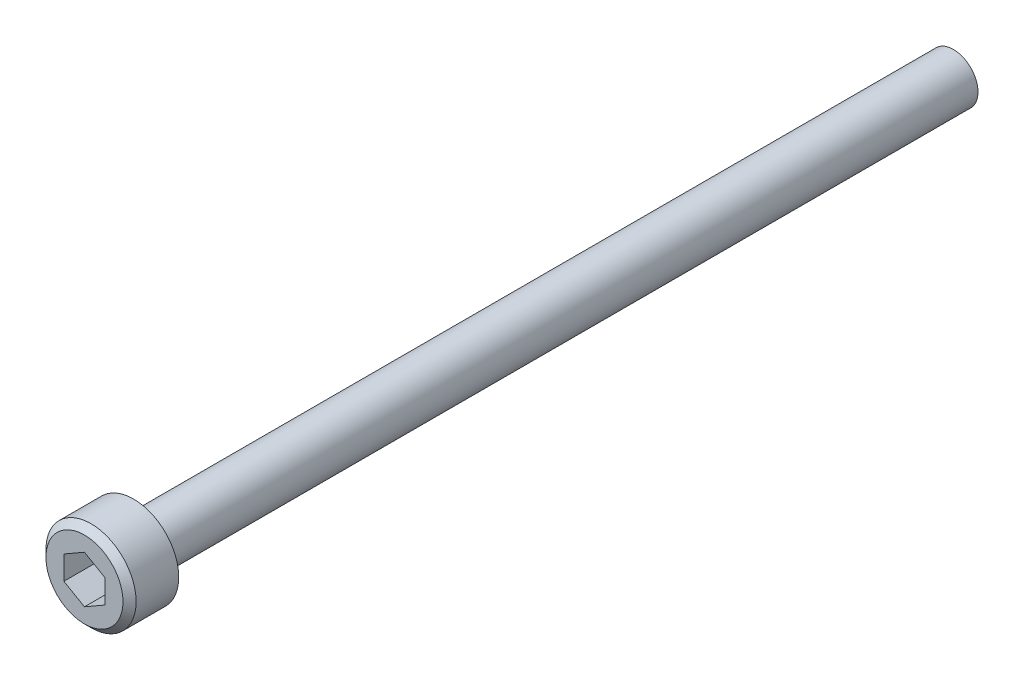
from build123d import *

# Parameters (mm, degrees)
SKETCH_1_W          = 2.75
SKETCH_1_H          = 3
SKETCH_2_R          = 1.5
EXTRUDE_1_DEPTH     = 50
CUT_EXTRUDE_1_DEPTH = 2.5
CHAMFER_1_SIZE      = 0.4
CHAMFER_2_SIZE      = 0.1


with BuildPart() as part:
    # Sketch 1 → Revolve 1 (revolve)
    with BuildSketch(Plane(origin=(0, 0, 0), x_dir=(1, 0, 0), z_dir=(0, 1, 0))):
        with Locations((1.375, -1.5)):
            Rectangle(SKETCH_1_W, SKETCH_1_H)
    revolve(axis=Axis((0, 0, 0), (0, 0, 1)))

    # Sketch 2 → Extrude 1 (add)
    with BuildSketch(Plane(origin=(0, 0, 0), x_dir=(-1, 0, 0), z_dir=(0, 0, -1))):
        Circle(SKETCH_2_R)
    extrude(amount=EXTRUDE_1_DEPTH)

    # Sketch 3 → Cut-Extrude 1 (cut)
    with BuildSketch(Plane.XY.offset(3)):
        Polygon((1.248513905, -0.724255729), (1.251480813, 0.719116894), (0.002966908, 1.443372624), (-1.248513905, 0.724255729), (-1.251480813, -0.719116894), (-0.002966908, -1.443372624), align=None)
    extrude(amount=-CUT_EXTRUDE_1_DEPTH, mode=Mode.SUBTRACT)

    # Chamfer 1
    chamfer_1_edges = [part.edges().sort_by_distance(p)[0] for p in [
        (-2.75, 0, 3),
    ]]
    chamfer(chamfer_1_edges, length=CHAMFER_1_SIZE)

    # Chamfer 2
    chamfer_2_edges = [part.edges().sort_by_distance(p)[0] for p in [
        (1.5, 0, 0),
    ]]
    chamfer(chamfer_2_edges, length=CHAMFER_2_SIZE)


solid = part.part
